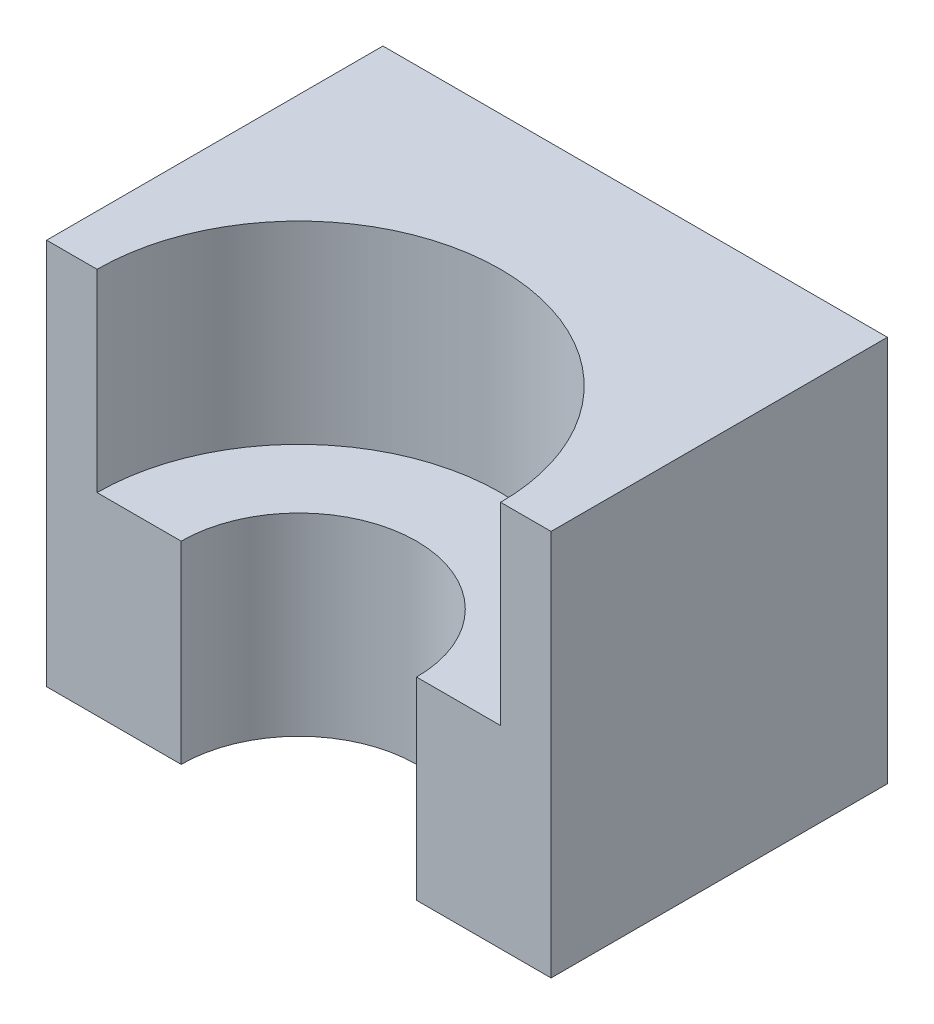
ISO-10303-21;
HEADER;
FILE_DESCRIPTION(('STEP AP214'),'2;1');
FILE_NAME('part.step','',(''),(''),'','','');
FILE_SCHEMA(('AUTOMOTIVE_DESIGN { 1 0 10303 214 1 1 1 1 }'));
ENDSEC;
DATA;
#1=APPLICATION_CONTEXT('core data for automotive mechanical design processes');
#2=APPLICATION_PROTOCOL_DEFINITION('international standard','automotive_design',2000,#1);
#3=PRODUCT_CONTEXT('',#1,'mechanical');
#4=PRODUCT('Part','Part','',(#3));
#5=PRODUCT_RELATED_PRODUCT_CATEGORY('part','',(#4));
#6=PRODUCT_DEFINITION_FORMATION('','',#4);
#7=PRODUCT_DEFINITION_CONTEXT('part definition',#1,'design');
#8=PRODUCT_DEFINITION('design','',#6,#7);
#9=PRODUCT_DEFINITION_SHAPE('','',#8);
#10=(LENGTH_UNIT() NAMED_UNIT(*) SI_UNIT(.MILLI.,.METRE.));
#11=(NAMED_UNIT(*) PLANE_ANGLE_UNIT() SI_UNIT($,.RADIAN.));
#12=(NAMED_UNIT(*) SI_UNIT($,.STERADIAN.) SOLID_ANGLE_UNIT());
#13=UNCERTAINTY_MEASURE_WITH_UNIT(LENGTH_MEASURE(1.E-05),#10,'distance_accuracy_value','');
#14=(GEOMETRIC_REPRESENTATION_CONTEXT(3) GLOBAL_UNCERTAINTY_ASSIGNED_CONTEXT((#13)) GLOBAL_UNIT_ASSIGNED_CONTEXT((#10,
#11,#12)) REPRESENTATION_CONTEXT('',''));
#15=CARTESIAN_POINT('',(0.,0.,0.));
#16=DIRECTION('',(0.,0.,1.));
#17=DIRECTION('',(1.,0.,0.));
#18=AXIS2_PLACEMENT_3D('',#15,#16,#17);
#19=CARTESIAN_POINT('',(-15.,11.5,-20.));
#20=DIRECTION('',(0.,1.,0.));
#21=DIRECTION('',(0.,0.,1.));
#22=AXIS2_PLACEMENT_3D('',#19,#20,#21);
#23=PLANE('',#22);
#24=DIRECTION('',(-1.,0.,0.));
#25=VECTOR('',#24,1.);
#26=CARTESIAN_POINT('',(-15.,11.5,0.));
#27=LINE('',#26,#25);
#28=CARTESIAN_POINT('',(-12.,11.5,0.));
#29=VERTEX_POINT('',#28);
#30=CARTESIAN_POINT('',(-15.,11.5,0.));
#31=VERTEX_POINT('',#30);
#32=EDGE_CURVE('E78',#29,#31,#27,.T.);
#33=ORIENTED_EDGE('',*,*,#32,.F.);
#34=CARTESIAN_POINT('',(0.,11.5,0.));
#35=DIRECTION('',(0.,-1.,0.));
#36=DIRECTION('',(0.,0.,-1.));
#37=AXIS2_PLACEMENT_3D('',#34,#35,#36);
#38=CIRCLE('',#37,12.);
#39=CARTESIAN_POINT('',(12.,11.5,0.));
#40=VERTEX_POINT('',#39);
#41=EDGE_CURVE('E108',#29,#40,#38,.T.);
#42=ORIENTED_EDGE('',*,*,#41,.T.);
#43=CARTESIAN_POINT('',(15.,11.5,0.));
#44=VERTEX_POINT('',#43);
#45=EDGE_CURVE('E138',#44,#40,#27,.T.);
#46=ORIENTED_EDGE('',*,*,#45,.F.);
#47=DIRECTION('',(0.,0.,1.));
#48=VECTOR('',#47,1.);
#49=CARTESIAN_POINT('',(15.,11.5,-20.));
#50=LINE('',#49,#48);
#51=CARTESIAN_POINT('',(15.,11.5,-20.));
#52=VERTEX_POINT('',#51);
#53=EDGE_CURVE('E129',#52,#44,#50,.T.);
#54=ORIENTED_EDGE('',*,*,#53,.F.);
#55=DIRECTION('',(-1.,0.,0.));
#56=VECTOR('',#55,1.);
#57=CARTESIAN_POINT('',(-15.,11.5,-20.));
#58=LINE('',#57,#56);
#59=CARTESIAN_POINT('',(-15.,11.5,-20.));
#60=VERTEX_POINT('',#59);
#61=EDGE_CURVE('E134',#52,#60,#58,.T.);
#62=ORIENTED_EDGE('',*,*,#61,.T.);
#63=DIRECTION('',(0.,0.,1.));
#64=VECTOR('',#63,1.);
#65=CARTESIAN_POINT('',(-15.,11.5,-20.));
#66=LINE('',#65,#64);
#67=EDGE_CURVE('E55',#60,#31,#66,.T.);
#68=ORIENTED_EDGE('',*,*,#67,.T.);
#69=EDGE_LOOP('',(#33,#42,#46,#54,#62,#68));
#70=FACE_BOUND('',#69,.T.);
#71=ADVANCED_FACE('F31',(#70),#23,.T.);
#72=CARTESIAN_POINT('',(-15.,-11.5,-20.));
#73=DIRECTION('',(0.,-1.,0.));
#74=DIRECTION('',(0.,0.,-1.));
#75=AXIS2_PLACEMENT_3D('',#72,#73,#74);
#76=PLANE('',#75);
#77=DIRECTION('',(1.,0.,0.));
#78=VECTOR('',#77,1.);
#79=CARTESIAN_POINT('',(-15.,-11.5,0.));
#80=LINE('',#79,#78);
#81=CARTESIAN_POINT('',(7.,-11.5,0.));
#82=VERTEX_POINT('',#81);
#83=CARTESIAN_POINT('',(15.,-11.5,0.));
#84=VERTEX_POINT('',#83);
#85=EDGE_CURVE('E146',#82,#84,#80,.T.);
#86=ORIENTED_EDGE('',*,*,#85,.F.);
#87=CARTESIAN_POINT('',(0.,-11.5,0.));
#88=DIRECTION('',(0.,-1.,0.));
#89=DIRECTION('',(0.,0.,-1.));
#90=AXIS2_PLACEMENT_3D('',#87,#88,#89);
#91=CIRCLE('',#90,7.);
#92=CARTESIAN_POINT('',(-7.,-11.5,0.));
#93=VERTEX_POINT('',#92);
#94=EDGE_CURVE('E149',#93,#82,#91,.T.);
#95=ORIENTED_EDGE('',*,*,#94,.F.);
#96=CARTESIAN_POINT('',(-15.,-11.5,0.));
#97=VERTEX_POINT('',#96);
#98=EDGE_CURVE('E144',#97,#93,#80,.T.);
#99=ORIENTED_EDGE('',*,*,#98,.F.);
#100=DIRECTION('',(0.,0.,1.));
#101=VECTOR('',#100,1.);
#102=CARTESIAN_POINT('',(-15.,-11.5,-20.));
#103=LINE('',#102,#101);
#104=CARTESIAN_POINT('',(-15.,-11.5,-20.));
#105=VERTEX_POINT('',#104);
#106=EDGE_CURVE('E84',#105,#97,#103,.T.);
#107=ORIENTED_EDGE('',*,*,#106,.F.);
#108=DIRECTION('',(1.,0.,0.));
#109=VECTOR('',#108,1.);
#110=CARTESIAN_POINT('',(-15.,-11.5,-20.));
#111=LINE('',#110,#109);
#112=CARTESIAN_POINT('',(15.,-11.5,-20.));
#113=VERTEX_POINT('',#112);
#114=EDGE_CURVE('E155',#105,#113,#111,.T.);
#115=ORIENTED_EDGE('',*,*,#114,.T.);
#116=DIRECTION('',(0.,0.,1.));
#117=VECTOR('',#116,1.);
#118=CARTESIAN_POINT('',(15.,-11.5,-20.));
#119=LINE('',#118,#117);
#120=EDGE_CURVE('E133',#113,#84,#119,.T.);
#121=ORIENTED_EDGE('',*,*,#120,.T.);
#122=EDGE_LOOP('',(#86,#95,#99,#107,#115,#121));
#123=FACE_BOUND('',#122,.T.);
#124=ADVANCED_FACE('F172',(#123),#76,.T.);
#125=CARTESIAN_POINT('',(-15.,-11.5,0.));
#126=DIRECTION('',(0.,0.,1.));
#127=DIRECTION('',(1.,0.,0.));
#128=AXIS2_PLACEMENT_3D('',#125,#126,#127);
#129=PLANE('',#128);
#130=ORIENTED_EDGE('',*,*,#98,.T.);
#131=DIRECTION('',(0.,-1.,0.));
#132=VECTOR('',#131,1.);
#133=CARTESIAN_POINT('',(-7.,0.,0.));
#134=LINE('',#133,#132);
#135=CARTESIAN_POINT('',(-7.,0.,0.));
#136=VERTEX_POINT('',#135);
#137=EDGE_CURVE('E11',#93,#136,#134,.F.);
#138=ORIENTED_EDGE('',*,*,#137,.T.);
#139=DIRECTION('',(-1.,0.,0.));
#140=VECTOR('',#139,1.);
#141=CARTESIAN_POINT('',(-15.,0.,0.));
#142=LINE('',#141,#140);
#143=CARTESIAN_POINT('',(-12.,0.,0.));
#144=VERTEX_POINT('',#143);
#145=EDGE_CURVE('E39',#136,#144,#142,.T.);
#146=ORIENTED_EDGE('',*,*,#145,.T.);
#147=DIRECTION('',(0.,-1.,0.));
#148=VECTOR('',#147,1.);
#149=CARTESIAN_POINT('',(-12.,0.,0.));
#150=LINE('',#149,#148);
#151=EDGE_CURVE('E105',#144,#29,#150,.F.);
#152=ORIENTED_EDGE('',*,*,#151,.T.);
#153=ORIENTED_EDGE('',*,*,#32,.T.);
#154=DIRECTION('',(0.,-1.,0.));
#155=VECTOR('',#154,1.);
#156=CARTESIAN_POINT('',(-15.,11.5,0.));
#157=LINE('',#156,#155);
#158=EDGE_CURVE('E147',#31,#97,#157,.T.);
#159=ORIENTED_EDGE('',*,*,#158,.T.);
#160=EDGE_LOOP('',(#130,#138,#146,#152,#153,#159));
#161=FACE_BOUND('',#160,.T.);
#162=ADVANCED_FACE('F121',(#161),#129,.T.);
#163=CARTESIAN_POINT('',(12.,0.,0.));
#164=VERTEX_POINT('',#163);
#165=CARTESIAN_POINT('',(7.,0.,0.));
#166=VERTEX_POINT('',#165);
#167=EDGE_CURVE('E116',#164,#166,#142,.T.);
#168=ORIENTED_EDGE('',*,*,#167,.T.);
#169=DIRECTION('',(0.,-1.,0.));
#170=VECTOR('',#169,1.);
#171=CARTESIAN_POINT('',(7.,0.,0.));
#172=LINE('',#171,#170);
#173=EDGE_CURVE('E110',#166,#82,#172,.T.);
#174=ORIENTED_EDGE('',*,*,#173,.T.);
#175=ORIENTED_EDGE('',*,*,#85,.T.);
#176=DIRECTION('',(0.,1.,0.));
#177=VECTOR('',#176,1.);
#178=CARTESIAN_POINT('',(15.,11.5,0.));
#179=LINE('',#178,#177);
#180=EDGE_CURVE('E141',#84,#44,#179,.T.);
#181=ORIENTED_EDGE('',*,*,#180,.T.);
#182=ORIENTED_EDGE('',*,*,#45,.T.);
#183=DIRECTION('',(0.,-1.,0.));
#184=VECTOR('',#183,1.);
#185=CARTESIAN_POINT('',(12.,0.,0.));
#186=LINE('',#185,#184);
#187=EDGE_CURVE('E125',#40,#164,#186,.T.);
#188=ORIENTED_EDGE('',*,*,#187,.T.);
#189=EDGE_LOOP('',(#168,#174,#175,#181,#182,#188));
#190=FACE_BOUND('',#189,.T.);
#191=ADVANCED_FACE('F162',(#190),#129,.T.);
#192=CARTESIAN_POINT('',(-15.,11.5,-20.));
#193=DIRECTION('',(-1.,0.,0.));
#194=DIRECTION('',(0.,0.,1.));
#195=AXIS2_PLACEMENT_3D('',#192,#193,#194);
#196=PLANE('',#195);
#197=ORIENTED_EDGE('',*,*,#158,.F.);
#198=ORIENTED_EDGE('',*,*,#67,.F.);
#199=DIRECTION('',(0.,-1.,0.));
#200=VECTOR('',#199,1.);
#201=CARTESIAN_POINT('',(-15.,11.5,-20.));
#202=LINE('',#201,#200);
#203=EDGE_CURVE('E140',#60,#105,#202,.T.);
#204=ORIENTED_EDGE('',*,*,#203,.T.);
#205=ORIENTED_EDGE('',*,*,#106,.T.);
#206=EDGE_LOOP('',(#197,#198,#204,#205));
#207=FACE_BOUND('',#206,.T.);
#208=ADVANCED_FACE('F33',(#207),#196,.T.);
#209=CARTESIAN_POINT('',(15.,11.5,-20.));
#210=DIRECTION('',(1.,0.,0.));
#211=DIRECTION('',(0.,0.,-1.));
#212=AXIS2_PLACEMENT_3D('',#209,#210,#211);
#213=PLANE('',#212);
#214=ORIENTED_EDGE('',*,*,#180,.F.);
#215=ORIENTED_EDGE('',*,*,#120,.F.);
#216=DIRECTION('',(0.,1.,0.));
#217=VECTOR('',#216,1.);
#218=CARTESIAN_POINT('',(15.,11.5,-20.));
#219=LINE('',#218,#217);
#220=EDGE_CURVE('E152',#113,#52,#219,.T.);
#221=ORIENTED_EDGE('',*,*,#220,.T.);
#222=ORIENTED_EDGE('',*,*,#53,.T.);
#223=EDGE_LOOP('',(#214,#215,#221,#222));
#224=FACE_BOUND('',#223,.T.);
#225=ADVANCED_FACE('F166',(#224),#213,.T.);
#226=CARTESIAN_POINT('',(-15.,-11.5,-20.));
#227=DIRECTION('',(0.,0.,1.));
#228=DIRECTION('',(1.,0.,0.));
#229=AXIS2_PLACEMENT_3D('',#226,#227,#228);
#230=PLANE('',#229);
#231=ORIENTED_EDGE('',*,*,#203,.F.);
#232=ORIENTED_EDGE('',*,*,#61,.F.);
#233=ORIENTED_EDGE('',*,*,#220,.F.);
#234=ORIENTED_EDGE('',*,*,#114,.F.);
#235=EDGE_LOOP('',(#231,#232,#233,#234));
#236=FACE_BOUND('',#235,.T.);
#237=ADVANCED_FACE('F170',(#236),#230,.F.);
#238=CARTESIAN_POINT('',(0.,0.,0.));
#239=DIRECTION('',(0.,-1.,0.));
#240=DIRECTION('',(0.,0.,-1.));
#241=AXIS2_PLACEMENT_3D('',#238,#239,#240);
#242=CYLINDRICAL_SURFACE('',#241,7.);
#243=ORIENTED_EDGE('',*,*,#94,.T.);
#244=ORIENTED_EDGE('',*,*,#173,.F.);
#245=CARTESIAN_POINT('',(0.,0.,0.));
#246=DIRECTION('',(0.,-1.,0.));
#247=DIRECTION('',(0.,0.,-1.));
#248=AXIS2_PLACEMENT_3D('',#245,#246,#247);
#249=CIRCLE('',#248,7.);
#250=EDGE_CURVE('E118',#136,#166,#249,.T.);
#251=ORIENTED_EDGE('',*,*,#250,.F.);
#252=ORIENTED_EDGE('',*,*,#137,.F.);
#253=EDGE_LOOP('',(#243,#244,#251,#252));
#254=FACE_BOUND('',#253,.T.);
#255=ADVANCED_FACE('F174',(#254),#242,.F.);
#256=CARTESIAN_POINT('',(12.,0.,0.));
#257=DIRECTION('',(0.,1.,0.));
#258=DIRECTION('',(0.,0.,1.));
#259=AXIS2_PLACEMENT_3D('',#256,#257,#258);
#260=PLANE('',#259);
#261=CARTESIAN_POINT('',(0.,0.,0.));
#262=DIRECTION('',(0.,-1.,0.));
#263=DIRECTION('',(0.,0.,-1.));
#264=AXIS2_PLACEMENT_3D('',#261,#262,#263);
#265=CIRCLE('',#264,12.);
#266=EDGE_CURVE('E46',#144,#164,#265,.T.);
#267=ORIENTED_EDGE('',*,*,#266,.F.);
#268=ORIENTED_EDGE('',*,*,#145,.F.);
#269=ORIENTED_EDGE('',*,*,#250,.T.);
#270=ORIENTED_EDGE('',*,*,#167,.F.);
#271=EDGE_LOOP('',(#267,#268,#269,#270));
#272=FACE_BOUND('',#271,.T.);
#273=ADVANCED_FACE('F112',(#272),#260,.T.);
#274=CARTESIAN_POINT('',(0.,0.,0.));
#275=DIRECTION('',(0.,-1.,0.));
#276=DIRECTION('',(0.,0.,-1.));
#277=AXIS2_PLACEMENT_3D('',#274,#275,#276);
#278=CYLINDRICAL_SURFACE('',#277,12.);
#279=ORIENTED_EDGE('',*,*,#266,.T.);
#280=ORIENTED_EDGE('',*,*,#187,.F.);
#281=ORIENTED_EDGE('',*,*,#41,.F.);
#282=ORIENTED_EDGE('',*,*,#151,.F.);
#283=EDGE_LOOP('',(#279,#280,#281,#282));
#284=FACE_BOUND('',#283,.T.);
#285=ADVANCED_FACE('F106',(#284),#278,.F.);
#286=CLOSED_SHELL('',(#71,#124,#162,#191,#208,#225,#237,#255,#273,#285));
#287=MANIFOLD_SOLID_BREP('B2',#286);
#288=ADVANCED_BREP_SHAPE_REPRESENTATION('',(#18,#287),#14);
#289=SHAPE_DEFINITION_REPRESENTATION(#9,#288);
ENDSEC;
END-ISO-10303-21;
